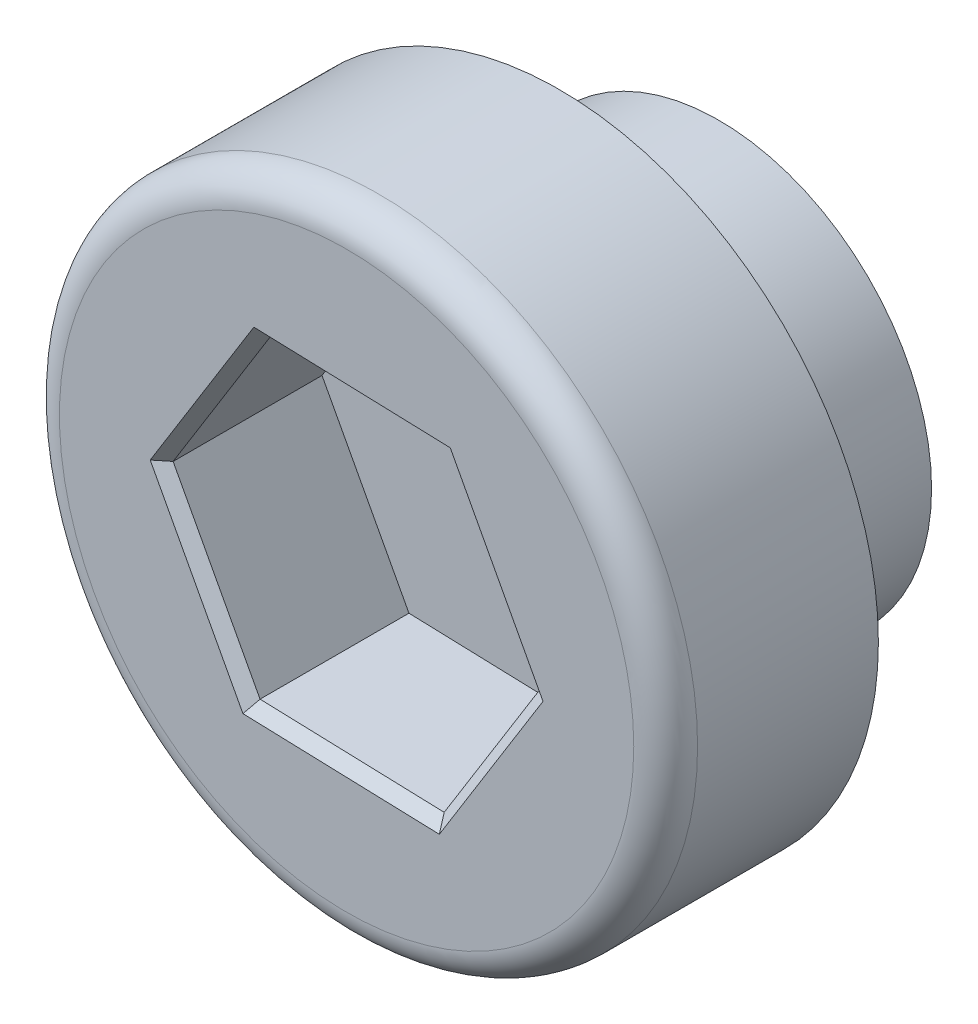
ISO-10303-21;
HEADER;
FILE_DESCRIPTION(('STEP AP214'),'2;1');
FILE_NAME('part.step','',(''),(''),'','','');
FILE_SCHEMA(('AUTOMOTIVE_DESIGN { 1 0 10303 214 1 1 1 1 }'));
ENDSEC;
DATA;
#1=APPLICATION_CONTEXT('core data for automotive mechanical design processes');
#2=APPLICATION_PROTOCOL_DEFINITION('international standard','automotive_design',2000,#1);
#3=PRODUCT_CONTEXT('',#1,'mechanical');
#4=PRODUCT('Part','Part','',(#3));
#5=PRODUCT_RELATED_PRODUCT_CATEGORY('part','',(#4));
#6=PRODUCT_DEFINITION_FORMATION('','',#4);
#7=PRODUCT_DEFINITION_CONTEXT('part definition',#1,'design');
#8=PRODUCT_DEFINITION('design','',#6,#7);
#9=PRODUCT_DEFINITION_SHAPE('','',#8);
#10=(LENGTH_UNIT() NAMED_UNIT(*) SI_UNIT(.MILLI.,.METRE.));
#11=(NAMED_UNIT(*) PLANE_ANGLE_UNIT() SI_UNIT($,.RADIAN.));
#12=(NAMED_UNIT(*) SI_UNIT($,.STERADIAN.) SOLID_ANGLE_UNIT());
#13=UNCERTAINTY_MEASURE_WITH_UNIT(LENGTH_MEASURE(1.E-05),#10,'distance_accuracy_value','');
#14=(GEOMETRIC_REPRESENTATION_CONTEXT(3) GLOBAL_UNCERTAINTY_ASSIGNED_CONTEXT((#13)) GLOBAL_UNIT_ASSIGNED_CONTEXT((#10,
#11,#12)) REPRESENTATION_CONTEXT('',''));
#15=CARTESIAN_POINT('',(0.,0.,0.));
#16=DIRECTION('',(0.,0.,1.));
#17=DIRECTION('',(1.,0.,0.));
#18=AXIS2_PLACEMENT_3D('',#15,#16,#17);
#19=CARTESIAN_POINT('',(0.,0.,3.));
#20=DIRECTION('',(0.,0.,-1.));
#21=DIRECTION('',(-1.,0.,0.));
#22=AXIS2_PLACEMENT_3D('',#19,#20,#21);
#23=CYLINDRICAL_SURFACE('',#22,4.);
#24=CARTESIAN_POINT('',(0.,0.,3.));
#25=DIRECTION('',(0.,0.,1.));
#26=DIRECTION('',(1.,0.,0.));
#27=AXIS2_PLACEMENT_3D('',#24,#25,#26);
#28=CIRCLE('',#27,4.);
#29=CARTESIAN_POINT('',(4.,0.,3.));
#30=VERTEX_POINT('',#29);
#31=EDGE_CURVE('E154',#30,#30,#28,.T.);
#32=ORIENTED_EDGE('',*,*,#31,.F.);
#33=EDGE_LOOP('',(#32));
#34=FACE_BOUND('',#33,.T.);
#35=CARTESIAN_POINT('',(0.,0.,0.));
#36=DIRECTION('',(0.,0.,1.));
#37=DIRECTION('',(1.,0.,0.));
#38=AXIS2_PLACEMENT_3D('',#35,#36,#37);
#39=CIRCLE('',#38,4.);
#40=CARTESIAN_POINT('',(4.,0.,0.));
#41=VERTEX_POINT('',#40);
#42=EDGE_CURVE('E153',#41,#41,#39,.T.);
#43=ORIENTED_EDGE('',*,*,#42,.T.);
#44=EDGE_LOOP('',(#43));
#45=FACE_BOUND('',#44,.T.);
#46=ADVANCED_FACE('F33',(#34,#45),#23,.T.);
#47=CARTESIAN_POINT('',(0.,0.,0.));
#48=DIRECTION('',(0.,0.,1.));
#49=DIRECTION('',(1.,0.,0.));
#50=AXIS2_PLACEMENT_3D('',#47,#48,#49);
#51=PLANE('',#50);
#52=ORIENTED_EDGE('',*,*,#42,.F.);
#53=EDGE_LOOP('',(#52));
#54=FACE_BOUND('',#53,.T.);
#55=ADVANCED_FACE('F231',(#54),#51,.F.);
#56=CARTESIAN_POINT('',(0.,0.,7.));
#57=DIRECTION('',(0.,0.,-1.));
#58=DIRECTION('',(-1.,0.,0.));
#59=AXIS2_PLACEMENT_3D('',#56,#57,#58);
#60=CYLINDRICAL_SURFACE('',#59,6.);
#61=CARTESIAN_POINT('',(0.,0.,6.4));
#62=DIRECTION('',(0.,0.,1.));
#63=DIRECTION('',(1.,0.,0.));
#64=AXIS2_PLACEMENT_3D('',#61,#62,#63);
#65=CIRCLE('',#64,6.);
#66=CARTESIAN_POINT('',(6.,0.,6.4));
#67=VERTEX_POINT('',#66);
#68=EDGE_CURVE('E162',#67,#67,#65,.F.);
#69=ORIENTED_EDGE('',*,*,#68,.T.);
#70=EDGE_LOOP('',(#69));
#71=FACE_BOUND('',#70,.T.);
#72=CARTESIAN_POINT('',(0.,0.,3.));
#73=DIRECTION('',(0.,0.,1.));
#74=DIRECTION('',(1.,0.,0.));
#75=AXIS2_PLACEMENT_3D('',#72,#73,#74);
#76=CIRCLE('',#75,6.);
#77=CARTESIAN_POINT('',(6.,0.,3.));
#78=VERTEX_POINT('',#77);
#79=EDGE_CURVE('E142',#78,#78,#76,.T.);
#80=ORIENTED_EDGE('',*,*,#79,.T.);
#81=EDGE_LOOP('',(#80));
#82=FACE_BOUND('',#81,.T.);
#83=ADVANCED_FACE('F237',(#71,#82),#60,.T.);
#84=CARTESIAN_POINT('',(0.,0.,7.));
#85=DIRECTION('',(0.,0.,1.));
#86=DIRECTION('',(1.,0.,0.));
#87=AXIS2_PLACEMENT_3D('',#84,#85,#86);
#88=PLANE('',#87);
#89=DIRECTION('',(-0.527537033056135,-0.849532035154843,0.));
#90=VECTOR('',#89,1.);
#91=CARTESIAN_POINT('',(1.80478156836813,-3.15955115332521,7.));
#92=LINE('',#91,#90);
#93=CARTESIAN_POINT('',(3.69313818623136,-0.118590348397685,7.));
#94=VERTEX_POINT('',#93);
#95=CARTESIAN_POINT('',(1.74386683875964,-3.25764666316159,7.));
#96=VERTEX_POINT('',#95);
#97=EDGE_CURVE('E168',#94,#96,#92,.T.);
#98=ORIENTED_EDGE('',*,*,#97,.T.);
#99=DIRECTION('',(-0.999484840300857,0.0320944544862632,0.));
#100=VECTOR('',#99,1.);
#101=CARTESIAN_POINT('',(-1.83386077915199,-3.14276226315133,7.));
#102=LINE('',#101,#100);
#103=CARTESIAN_POINT('',(-1.94927134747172,-3.1390563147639,7.));
#104=VERTEX_POINT('',#103);
#105=EDGE_CURVE('E178',#96,#104,#102,.T.);
#106=ORIENTED_EDGE('',*,*,#105,.T.);
#107=DIRECTION('',(-0.471947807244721,0.881626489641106,0.));
#108=VECTOR('',#107,1.);
#109=CARTESIAN_POINT('',(-3.63864234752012,0.0167888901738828,7.));
#110=LINE('',#109,#108);
#111=CARTESIAN_POINT('',(-3.69313818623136,0.118590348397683,7.));
#112=VERTEX_POINT('',#111);
#113=EDGE_CURVE('E176',#104,#112,#110,.T.);
#114=ORIENTED_EDGE('',*,*,#113,.T.);
#115=DIRECTION('',(0.527537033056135,0.849532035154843,0.));
#116=VECTOR('',#115,1.);
#117=CARTESIAN_POINT('',(-1.80478156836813,3.15955115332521,7.));
#118=LINE('',#117,#116);
#119=CARTESIAN_POINT('',(-1.74386683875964,3.25764666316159,7.));
#120=VERTEX_POINT('',#119);
#121=EDGE_CURVE('E174',#112,#120,#118,.T.);
#122=ORIENTED_EDGE('',*,*,#121,.T.);
#123=DIRECTION('',(0.999484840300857,-0.0320944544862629,0.));
#124=VECTOR('',#123,1.);
#125=CARTESIAN_POINT('',(1.83386077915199,3.14276226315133,7.));
#126=LINE('',#125,#124);
#127=CARTESIAN_POINT('',(1.94927134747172,3.1390563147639,7.));
#128=VERTEX_POINT('',#127);
#129=EDGE_CURVE('E172',#120,#128,#126,.T.);
#130=ORIENTED_EDGE('',*,*,#129,.T.);
#131=DIRECTION('',(0.471947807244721,-0.881626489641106,0.));
#132=VECTOR('',#131,1.);
#133=CARTESIAN_POINT('',(3.63864234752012,-0.0167888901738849,7.));
#134=LINE('',#133,#132);
#135=EDGE_CURVE('E170',#128,#94,#134,.T.);
#136=ORIENTED_EDGE('',*,*,#135,.T.);
#137=EDGE_LOOP('',(#98,#106,#114,#122,#130,#136));
#138=FACE_BOUND('',#137,.T.);
#139=CARTESIAN_POINT('',(0.,0.,7.));
#140=DIRECTION('',(0.,0.,1.));
#141=DIRECTION('',(1.,0.,0.));
#142=AXIS2_PLACEMENT_3D('',#139,#140,#141);
#143=CIRCLE('',#142,5.4);
#144=CARTESIAN_POINT('',(5.4,0.,7.));
#145=VERTEX_POINT('',#144);
#146=EDGE_CURVE('E157',#145,#145,#143,.T.);
#147=ORIENTED_EDGE('',*,*,#146,.T.);
#148=EDGE_LOOP('',(#147));
#149=FACE_BOUND('',#148,.T.);
#150=ADVANCED_FACE('F317',(#138,#149),#88,.T.);
#151=CARTESIAN_POINT('',(0.,0.,3.));
#152=DIRECTION('',(0.,0.,1.));
#153=DIRECTION('',(1.,0.,0.));
#154=AXIS2_PLACEMENT_3D('',#151,#152,#153);
#155=PLANE('',#154);
#156=ORIENTED_EDGE('',*,*,#31,.T.);
#157=EDGE_LOOP('',(#156));
#158=FACE_BOUND('',#157,.T.);
#159=ORIENTED_EDGE('',*,*,#79,.F.);
#160=EDGE_LOOP('',(#159));
#161=FACE_BOUND('',#160,.T.);
#162=ADVANCED_FACE('F227',(#158,#161),#155,.F.);
#163=CARTESIAN_POINT('',(1.82744188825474,2.94286529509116,4.));
#164=DIRECTION('',(0.0320944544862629,0.999484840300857,0.));
#165=DIRECTION('',(-0.999484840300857,0.0320944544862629,0.));
#166=AXIS2_PLACEMENT_3D('',#163,#164,#165);
#167=PLANE('',#166);
#168=DIRECTION('',(0.,0.,1.));
#169=VECTOR('',#168,1.);
#170=CARTESIAN_POINT('',(1.82744188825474,2.94286529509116,4.));
#171=LINE('',#170,#169);
#172=CARTESIAN_POINT('',(1.82744188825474,2.94286529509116,4.));
#173=VERTEX_POINT('',#172);
#174=CARTESIAN_POINT('',(1.82744188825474,2.94286529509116,6.8));
#175=VERTEX_POINT('',#174);
#176=EDGE_CURVE('E140',#173,#175,#171,.T.);
#177=ORIENTED_EDGE('',*,*,#176,.T.);
#178=DIRECTION('',(-0.999484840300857,0.0320944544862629,0.));
#179=VECTOR('',#178,1.);
#180=CARTESIAN_POINT('',(-1.63487516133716,3.05404374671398,6.8));
#181=LINE('',#180,#179);
#182=CARTESIAN_POINT('',(-1.63487516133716,3.05404374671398,6.8));
#183=VERTEX_POINT('',#182);
#184=EDGE_CURVE('E111',#175,#183,#181,.T.);
#185=ORIENTED_EDGE('',*,*,#184,.T.);
#186=DIRECTION('',(0.,0.,1.));
#187=VECTOR('',#186,1.);
#188=CARTESIAN_POINT('',(-1.63487516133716,3.05404374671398,4.));
#189=LINE('',#188,#187);
#190=CARTESIAN_POINT('',(-1.63487516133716,3.05404374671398,4.));
#191=VERTEX_POINT('',#190);
#192=EDGE_CURVE('E104',#191,#183,#189,.T.);
#193=ORIENTED_EDGE('',*,*,#192,.F.);
#194=DIRECTION('',(-0.999484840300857,0.0320944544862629,0.));
#195=VECTOR('',#194,1.);
#196=CARTESIAN_POINT('',(1.82744188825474,2.94286529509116,4.));
#197=LINE('',#196,#195);
#198=EDGE_CURVE('E108',#173,#191,#197,.T.);
#199=ORIENTED_EDGE('',*,*,#198,.F.);
#200=EDGE_LOOP('',(#177,#185,#193,#199));
#201=FACE_BOUND('',#200,.T.);
#202=ADVANCED_FACE('F106',(#201),#167,.F.);
#203=CARTESIAN_POINT('',(3.4623170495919,-0.11117845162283,4.));
#204=DIRECTION('',(0.881626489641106,0.471947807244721,0.));
#205=DIRECTION('',(-0.471947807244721,0.881626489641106,0.));
#206=AXIS2_PLACEMENT_3D('',#203,#204,#205);
#207=PLANE('',#206);
#208=DIRECTION('',(0.,0.,1.));
#209=VECTOR('',#208,1.);
#210=CARTESIAN_POINT('',(3.4623170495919,-0.11117845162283,4.));
#211=LINE('',#210,#209);
#212=CARTESIAN_POINT('',(3.4623170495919,-0.11117845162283,4.));
#213=VERTEX_POINT('',#212);
#214=CARTESIAN_POINT('',(3.4623170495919,-0.11117845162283,6.8));
#215=VERTEX_POINT('',#214);
#216=EDGE_CURVE('E143',#213,#215,#211,.T.);
#217=ORIENTED_EDGE('',*,*,#216,.T.);
#218=DIRECTION('',(-0.471947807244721,0.881626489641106,0.));
#219=VECTOR('',#218,1.);
#220=CARTESIAN_POINT('',(1.82744188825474,2.94286529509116,6.8));
#221=LINE('',#220,#219);
#222=EDGE_CURVE('E42',#215,#175,#221,.T.);
#223=ORIENTED_EDGE('',*,*,#222,.T.);
#224=ORIENTED_EDGE('',*,*,#176,.F.);
#225=DIRECTION('',(-0.471947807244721,0.881626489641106,0.));
#226=VECTOR('',#225,1.);
#227=CARTESIAN_POINT('',(3.4623170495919,-0.11117845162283,4.));
#228=LINE('',#227,#226);
#229=EDGE_CURVE('E115',#213,#173,#228,.T.);
#230=ORIENTED_EDGE('',*,*,#229,.F.);
#231=EDGE_LOOP('',(#217,#223,#224,#230));
#232=FACE_BOUND('',#231,.T.);
#233=ADVANCED_FACE('F219',(#232),#207,.F.);
#234=CARTESIAN_POINT('',(1.63487516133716,-3.05404374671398,4.));
#235=DIRECTION('',(0.849532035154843,-0.527537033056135,0.));
#236=DIRECTION('',(0.527537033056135,0.849532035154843,0.));
#237=AXIS2_PLACEMENT_3D('',#234,#235,#236);
#238=PLANE('',#237);
#239=DIRECTION('',(0.,0.,1.));
#240=VECTOR('',#239,1.);
#241=CARTESIAN_POINT('',(1.63487516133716,-3.05404374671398,4.));
#242=LINE('',#241,#240);
#243=CARTESIAN_POINT('',(1.63487516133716,-3.05404374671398,4.));
#244=VERTEX_POINT('',#243);
#245=CARTESIAN_POINT('',(1.63487516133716,-3.05404374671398,6.8));
#246=VERTEX_POINT('',#245);
#247=EDGE_CURVE('E145',#244,#246,#242,.T.);
#248=ORIENTED_EDGE('',*,*,#247,.T.);
#249=DIRECTION('',(0.527537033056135,0.849532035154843,0.));
#250=VECTOR('',#249,1.);
#251=CARTESIAN_POINT('',(3.4623170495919,-0.11117845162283,6.8));
#252=LINE('',#251,#250);
#253=EDGE_CURVE('E11',#246,#215,#252,.T.);
#254=ORIENTED_EDGE('',*,*,#253,.T.);
#255=ORIENTED_EDGE('',*,*,#216,.F.);
#256=DIRECTION('',(0.527537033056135,0.849532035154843,0.));
#257=VECTOR('',#256,1.);
#258=CARTESIAN_POINT('',(1.63487516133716,-3.05404374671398,4.));
#259=LINE('',#258,#257);
#260=EDGE_CURVE('E137',#244,#213,#259,.T.);
#261=ORIENTED_EDGE('',*,*,#260,.F.);
#262=EDGE_LOOP('',(#248,#254,#255,#261));
#263=FACE_BOUND('',#262,.T.);
#264=ADVANCED_FACE('F218',(#263),#238,.F.);
#265=CARTESIAN_POINT('',(-1.82744188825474,-2.94286529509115,4.));
#266=DIRECTION('',(-0.0320944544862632,-0.999484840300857,0.));
#267=DIRECTION('',(0.999484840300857,-0.0320944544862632,0.));
#268=AXIS2_PLACEMENT_3D('',#265,#266,#267);
#269=PLANE('',#268);
#270=DIRECTION('',(0.,0.,1.));
#271=VECTOR('',#270,1.);
#272=CARTESIAN_POINT('',(-1.82744188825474,-2.94286529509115,4.));
#273=LINE('',#272,#271);
#274=CARTESIAN_POINT('',(-1.82744188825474,-2.94286529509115,4.));
#275=VERTEX_POINT('',#274);
#276=CARTESIAN_POINT('',(-1.82744188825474,-2.94286529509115,6.8));
#277=VERTEX_POINT('',#276);
#278=EDGE_CURVE('E147',#275,#277,#273,.T.);
#279=ORIENTED_EDGE('',*,*,#278,.T.);
#280=DIRECTION('',(0.999484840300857,-0.0320944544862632,0.));
#281=VECTOR('',#280,1.);
#282=CARTESIAN_POINT('',(1.63487516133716,-3.05404374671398,6.8));
#283=LINE('',#282,#281);
#284=EDGE_CURVE('E165',#277,#246,#283,.T.);
#285=ORIENTED_EDGE('',*,*,#284,.T.);
#286=ORIENTED_EDGE('',*,*,#247,.F.);
#287=DIRECTION('',(0.999484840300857,-0.0320944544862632,0.));
#288=VECTOR('',#287,1.);
#289=CARTESIAN_POINT('',(-1.82744188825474,-2.94286529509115,4.));
#290=LINE('',#289,#288);
#291=EDGE_CURVE('E134',#275,#244,#290,.T.);
#292=ORIENTED_EDGE('',*,*,#291,.F.);
#293=EDGE_LOOP('',(#279,#285,#286,#292));
#294=FACE_BOUND('',#293,.T.);
#295=ADVANCED_FACE('F215',(#294),#269,.F.);
#296=CARTESIAN_POINT('',(-3.4623170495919,0.111178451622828,4.));
#297=DIRECTION('',(-0.881626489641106,-0.471947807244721,0.));
#298=DIRECTION('',(0.471947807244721,-0.881626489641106,0.));
#299=AXIS2_PLACEMENT_3D('',#296,#297,#298);
#300=PLANE('',#299);
#301=DIRECTION('',(0.,0.,1.));
#302=VECTOR('',#301,1.);
#303=CARTESIAN_POINT('',(-3.4623170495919,0.111178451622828,4.));
#304=LINE('',#303,#302);
#305=CARTESIAN_POINT('',(-3.4623170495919,0.111178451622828,4.));
#306=VERTEX_POINT('',#305);
#307=CARTESIAN_POINT('',(-3.4623170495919,0.111178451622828,6.8));
#308=VERTEX_POINT('',#307);
#309=EDGE_CURVE('E114',#306,#308,#304,.T.);
#310=ORIENTED_EDGE('',*,*,#309,.T.);
#311=DIRECTION('',(0.471947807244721,-0.881626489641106,0.));
#312=VECTOR('',#311,1.);
#313=CARTESIAN_POINT('',(-1.82744188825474,-2.94286529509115,6.8));
#314=LINE('',#313,#312);
#315=EDGE_CURVE('E181',#308,#277,#314,.T.);
#316=ORIENTED_EDGE('',*,*,#315,.T.);
#317=ORIENTED_EDGE('',*,*,#278,.F.);
#318=DIRECTION('',(0.471947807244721,-0.881626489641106,0.));
#319=VECTOR('',#318,1.);
#320=CARTESIAN_POINT('',(-3.4623170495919,0.111178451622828,4.));
#321=LINE('',#320,#319);
#322=EDGE_CURVE('E124',#306,#275,#321,.T.);
#323=ORIENTED_EDGE('',*,*,#322,.F.);
#324=EDGE_LOOP('',(#310,#316,#317,#323));
#325=FACE_BOUND('',#324,.T.);
#326=ADVANCED_FACE('F211',(#325),#300,.F.);
#327=CARTESIAN_POINT('',(-1.63487516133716,3.05404374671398,4.));
#328=DIRECTION('',(-0.849532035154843,0.527537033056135,0.));
#329=DIRECTION('',(-0.527537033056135,-0.849532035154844,0.));
#330=AXIS2_PLACEMENT_3D('',#327,#328,#329);
#331=PLANE('',#330);
#332=ORIENTED_EDGE('',*,*,#192,.T.);
#333=DIRECTION('',(-0.527537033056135,-0.849532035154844,0.));
#334=VECTOR('',#333,1.);
#335=CARTESIAN_POINT('',(-3.4623170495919,0.111178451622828,6.8));
#336=LINE('',#335,#334);
#337=EDGE_CURVE('E183',#183,#308,#336,.T.);
#338=ORIENTED_EDGE('',*,*,#337,.T.);
#339=ORIENTED_EDGE('',*,*,#309,.F.);
#340=DIRECTION('',(-0.527537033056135,-0.849532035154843,0.));
#341=VECTOR('',#340,1.);
#342=CARTESIAN_POINT('',(-1.63487516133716,3.05404374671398,4.));
#343=LINE('',#342,#341);
#344=EDGE_CURVE('E118',#191,#306,#343,.T.);
#345=ORIENTED_EDGE('',*,*,#344,.F.);
#346=EDGE_LOOP('',(#332,#338,#339,#345));
#347=FACE_BOUND('',#346,.T.);
#348=ADVANCED_FACE('F119',(#347),#331,.F.);
#349=CARTESIAN_POINT('',(0.,0.,4.));
#350=DIRECTION('',(0.,0.,1.));
#351=DIRECTION('',(1.,0.,0.));
#352=AXIS2_PLACEMENT_3D('',#349,#350,#351);
#353=PLANE('',#352);
#354=ORIENTED_EDGE('',*,*,#198,.T.);
#355=ORIENTED_EDGE('',*,*,#344,.T.);
#356=ORIENTED_EDGE('',*,*,#322,.T.);
#357=ORIENTED_EDGE('',*,*,#291,.T.);
#358=ORIENTED_EDGE('',*,*,#260,.T.);
#359=ORIENTED_EDGE('',*,*,#229,.T.);
#360=EDGE_LOOP('',(#354,#355,#356,#357,#358,#359));
#361=FACE_BOUND('',#360,.T.);
#362=ADVANCED_FACE('F126',(#361),#353,.T.);
#363=CARTESIAN_POINT('',(0.,0.,6.4));
#364=DIRECTION('',(0.,0.,1.));
#365=DIRECTION('',(1.,0.,0.));
#366=AXIS2_PLACEMENT_3D('',#363,#364,#365);
#367=TOROIDAL_SURFACE('',#366,5.4,0.6);
#368=ORIENTED_EDGE('',*,*,#68,.F.);
#369=EDGE_LOOP('',(#368));
#370=FACE_BOUND('',#369,.T.);
#371=ORIENTED_EDGE('',*,*,#146,.F.);
#372=EDGE_LOOP('',(#371));
#373=FACE_BOUND('',#372,.T.);
#374=ADVANCED_FACE('F244',(#370,#373),#367,.T.);
#375=CARTESIAN_POINT('',(1.82744188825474,2.94286529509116,6.8));
#376=DIRECTION('',(-0.0226942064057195,-0.706742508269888,0.707106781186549));
#377=DIRECTION('',(0.999484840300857,-0.0320944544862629,0.));
#378=AXIS2_PLACEMENT_3D('',#375,#376,#377);
#379=PLANE('',#378);
#380=DIRECTION('',(-0.398780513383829,-0.642185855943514,-0.654653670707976));
#381=VECTOR('',#380,1.);
#382=CARTESIAN_POINT('',(1.82744188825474,2.94286529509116,6.8));
#383=LINE('',#382,#381);
#384=EDGE_CURVE('E131',#128,#175,#383,.T.);
#385=ORIENTED_EDGE('',*,*,#384,.F.);
#386=ORIENTED_EDGE('',*,*,#129,.F.);
#387=DIRECTION('',(0.356759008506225,-0.666446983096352,-0.654653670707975));
#388=VECTOR('',#387,1.);
#389=CARTESIAN_POINT('',(-1.63487516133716,3.05404374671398,6.8));
#390=LINE('',#389,#388);
#391=EDGE_CURVE('E37',#183,#120,#390,.F.);
#392=ORIENTED_EDGE('',*,*,#391,.F.);
#393=ORIENTED_EDGE('',*,*,#184,.F.);
#394=EDGE_LOOP('',(#385,#386,#392,#393));
#395=FACE_BOUND('',#394,.T.);
#396=ADVANCED_FACE('F35',(#395),#379,.T.);
#397=CARTESIAN_POINT('',(-1.63487516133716,3.05404374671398,6.8));
#398=DIRECTION('',(0.600709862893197,-0.373025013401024,0.70710678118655));
#399=DIRECTION('',(0.527537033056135,0.849532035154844,0.));
#400=AXIS2_PLACEMENT_3D('',#397,#398,#399);
#401=PLANE('',#400);
#402=ORIENTED_EDGE('',*,*,#391,.T.);
#403=ORIENTED_EDGE('',*,*,#121,.F.);
#404=DIRECTION('',(0.755539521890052,-0.0242611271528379,-0.654653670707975));
#405=VECTOR('',#404,1.);
#406=CARTESIAN_POINT('',(-3.4623170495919,0.111178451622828,6.8));
#407=LINE('',#406,#405);
#408=EDGE_CURVE('E194',#308,#112,#407,.F.);
#409=ORIENTED_EDGE('',*,*,#408,.F.);
#410=ORIENTED_EDGE('',*,*,#337,.F.);
#411=EDGE_LOOP('',(#402,#403,#409,#410));
#412=FACE_BOUND('',#411,.T.);
#413=ADVANCED_FACE('F208',(#412),#401,.T.);
#414=CARTESIAN_POINT('',(3.4623170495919,-0.11117845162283,6.8));
#415=DIRECTION('',(-0.623404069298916,-0.333717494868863,0.707106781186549));
#416=DIRECTION('',(0.471947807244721,-0.881626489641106,0.));
#417=AXIS2_PLACEMENT_3D('',#414,#415,#416);
#418=PLANE('',#417);
#419=ORIENTED_EDGE('',*,*,#384,.T.);
#420=ORIENTED_EDGE('',*,*,#222,.F.);
#421=DIRECTION('',(-0.755539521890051,0.0242611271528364,-0.654653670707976));
#422=VECTOR('',#421,1.);
#423=CARTESIAN_POINT('',(3.4623170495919,-0.11117845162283,6.8));
#424=LINE('',#423,#422);
#425=EDGE_CURVE('E191',#94,#215,#424,.T.);
#426=ORIENTED_EDGE('',*,*,#425,.F.);
#427=ORIENTED_EDGE('',*,*,#135,.F.);
#428=EDGE_LOOP('',(#419,#420,#426,#427));
#429=FACE_BOUND('',#428,.T.);
#430=ADVANCED_FACE('F200',(#429),#418,.T.);
#431=CARTESIAN_POINT('',(-3.4623170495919,0.111178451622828,6.8));
#432=DIRECTION('',(0.623404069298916,0.333717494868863,0.707106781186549));
#433=DIRECTION('',(-0.471947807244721,0.881626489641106,0.));
#434=AXIS2_PLACEMENT_3D('',#431,#432,#433);
#435=PLANE('',#434);
#436=ORIENTED_EDGE('',*,*,#408,.T.);
#437=ORIENTED_EDGE('',*,*,#113,.F.);
#438=DIRECTION('',(0.398780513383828,0.642185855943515,-0.654653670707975));
#439=VECTOR('',#438,1.);
#440=CARTESIAN_POINT('',(-1.82744188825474,-2.94286529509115,6.8));
#441=LINE('',#440,#439);
#442=EDGE_CURVE('E189',#277,#104,#441,.F.);
#443=ORIENTED_EDGE('',*,*,#442,.F.);
#444=ORIENTED_EDGE('',*,*,#315,.F.);
#445=EDGE_LOOP('',(#436,#437,#443,#444));
#446=FACE_BOUND('',#445,.T.);
#447=ADVANCED_FACE('F255',(#446),#435,.T.);
#448=CARTESIAN_POINT('',(1.63487516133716,-3.05404374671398,6.8));
#449=DIRECTION('',(-0.600709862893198,0.373025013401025,0.707106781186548));
#450=DIRECTION('',(-0.527537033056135,-0.849532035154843,0.));
#451=AXIS2_PLACEMENT_3D('',#448,#449,#450);
#452=PLANE('',#451);
#453=ORIENTED_EDGE('',*,*,#425,.T.);
#454=ORIENTED_EDGE('',*,*,#253,.F.);
#455=DIRECTION('',(0.356759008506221,-0.666446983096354,0.654653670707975));
#456=VECTOR('',#455,1.);
#457=CARTESIAN_POINT('',(1.16776797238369,-2.18145981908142,5.94285714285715));
#458=LINE('',#457,#456);
#459=EDGE_CURVE('E187',#96,#246,#458,.F.);
#460=ORIENTED_EDGE('',*,*,#459,.F.);
#461=ORIENTED_EDGE('',*,*,#97,.F.);
#462=EDGE_LOOP('',(#453,#454,#460,#461));
#463=FACE_BOUND('',#462,.T.);
#464=ADVANCED_FACE('F251',(#463),#452,.T.);
#465=CARTESIAN_POINT('',(-1.82744188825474,-2.94286529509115,6.8));
#466=DIRECTION('',(0.0226942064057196,0.706742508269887,0.70710678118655));
#467=DIRECTION('',(-0.999484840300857,0.0320944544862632,0.));
#468=AXIS2_PLACEMENT_3D('',#465,#466,#467);
#469=PLANE('',#468);
#470=ORIENTED_EDGE('',*,*,#442,.T.);
#471=ORIENTED_EDGE('',*,*,#105,.F.);
#472=ORIENTED_EDGE('',*,*,#459,.T.);
#473=ORIENTED_EDGE('',*,*,#284,.F.);
#474=EDGE_LOOP('',(#470,#471,#472,#473));
#475=FACE_BOUND('',#474,.T.);
#476=ADVANCED_FACE('F248',(#475),#469,.T.);
#477=CLOSED_SHELL('',(#46,#55,#83,#150,#162,#202,#233,#264,#295,#326,#348,#362,#374,#396,#413,
#430,#447,#464,#476));
#478=MANIFOLD_SOLID_BREP('B2',#477);
#479=ADVANCED_BREP_SHAPE_REPRESENTATION('',(#18,#478),#14);
#480=SHAPE_DEFINITION_REPRESENTATION(#9,#479);
ENDSEC;
END-ISO-10303-21;
